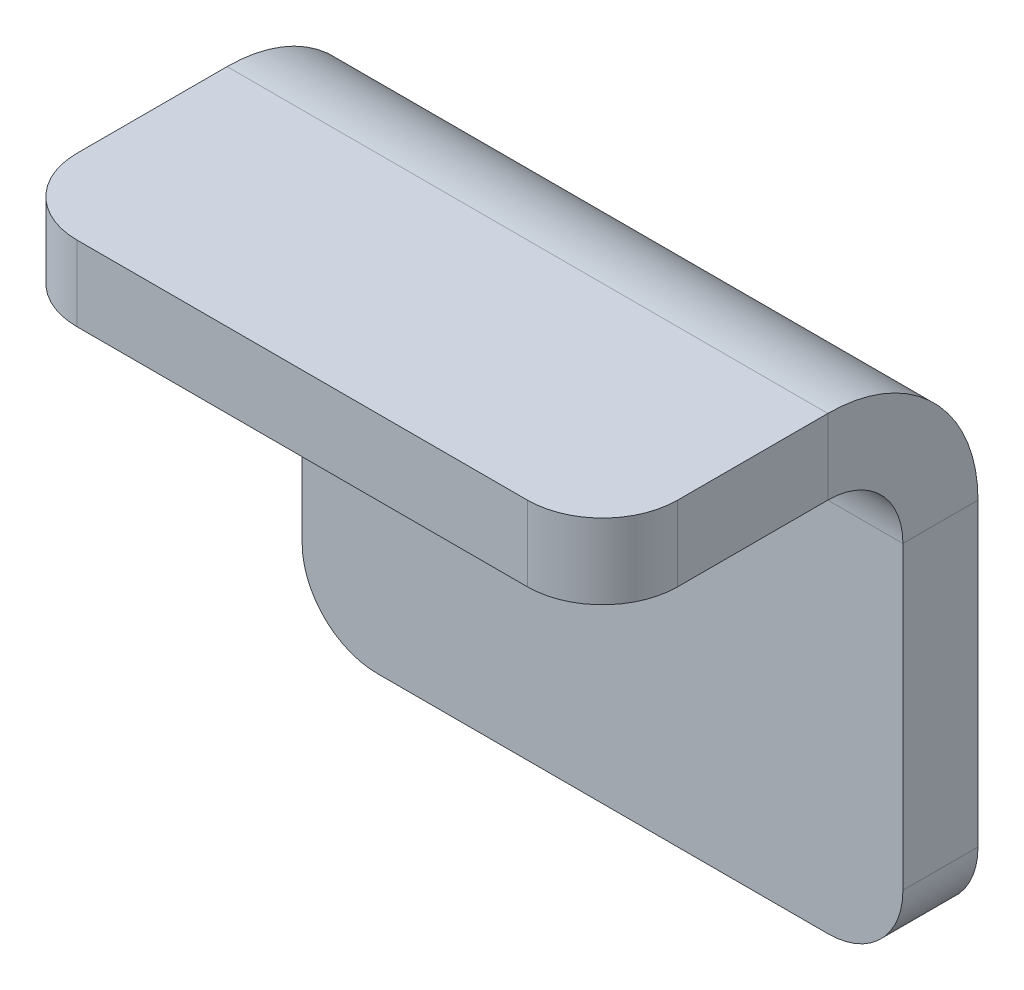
ISO-10303-21;
HEADER;
FILE_DESCRIPTION(('STEP AP214'),'2;1');
FILE_NAME('part.step','',(''),(''),'','','');
FILE_SCHEMA(('AUTOMOTIVE_DESIGN { 1 0 10303 214 1 1 1 1 }'));
ENDSEC;
DATA;
#1=APPLICATION_CONTEXT('core data for automotive mechanical design processes');
#2=APPLICATION_PROTOCOL_DEFINITION('international standard','automotive_design',2000,#1);
#3=PRODUCT_CONTEXT('',#1,'mechanical');
#4=PRODUCT('Part','Part','',(#3));
#5=PRODUCT_RELATED_PRODUCT_CATEGORY('part','',(#4));
#6=PRODUCT_DEFINITION_FORMATION('','',#4);
#7=PRODUCT_DEFINITION_CONTEXT('part definition',#1,'design');
#8=PRODUCT_DEFINITION('design','',#6,#7);
#9=PRODUCT_DEFINITION_SHAPE('','',#8);
#10=(LENGTH_UNIT() NAMED_UNIT(*) SI_UNIT(.MILLI.,.METRE.));
#11=(NAMED_UNIT(*) PLANE_ANGLE_UNIT() SI_UNIT($,.RADIAN.));
#12=(NAMED_UNIT(*) SI_UNIT($,.STERADIAN.) SOLID_ANGLE_UNIT());
#13=UNCERTAINTY_MEASURE_WITH_UNIT(LENGTH_MEASURE(1.E-05),#10,'distance_accuracy_value','');
#14=(GEOMETRIC_REPRESENTATION_CONTEXT(3) GLOBAL_UNCERTAINTY_ASSIGNED_CONTEXT((#13)) GLOBAL_UNIT_ASSIGNED_CONTEXT((#10,
#11,#12)) REPRESENTATION_CONTEXT('',''));
#15=CARTESIAN_POINT('',(0.,0.,0.));
#16=DIRECTION('',(0.,0.,1.));
#17=DIRECTION('',(1.,0.,0.));
#18=AXIS2_PLACEMENT_3D('',#15,#16,#17);
#19=CARTESIAN_POINT('',(-12.7,9.525,-3.175));
#20=DIRECTION('',(-1.,0.,0.));
#21=DIRECTION('',(0.,-1.,0.));
#22=AXIS2_PLACEMENT_3D('',#19,#20,#21);
#23=PLANE('',#22);
#24=DIRECTION('',(0.,-1.,0.));
#25=VECTOR('',#24,1.);
#26=CARTESIAN_POINT('',(-12.7,9.525,-3.175));
#27=LINE('',#26,#25);
#28=CARTESIAN_POINT('',(-12.7,6.35000000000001,-3.175));
#29=VERTEX_POINT('',#28);
#30=CARTESIAN_POINT('',(-12.7,-6.34999999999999,-3.175));
#31=VERTEX_POINT('',#30);
#32=EDGE_CURVE('E187',#29,#31,#27,.T.);
#33=ORIENTED_EDGE('',*,*,#32,.T.);
#34=DIRECTION('',(0.,0.,1.));
#35=VECTOR('',#34,1.);
#36=CARTESIAN_POINT('',(-12.7,-6.35,-3.175));
#37=LINE('',#36,#35);
#38=CARTESIAN_POINT('',(-12.7,-6.34999999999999,0.));
#39=VERTEX_POINT('',#38);
#40=EDGE_CURVE('E194',#31,#39,#37,.T.);
#41=ORIENTED_EDGE('',*,*,#40,.T.);
#42=DIRECTION('',(0.,-1.,0.));
#43=VECTOR('',#42,1.);
#44=CARTESIAN_POINT('',(-12.7,9.525,0.));
#45=LINE('',#44,#43);
#46=CARTESIAN_POINT('',(-12.7,6.35000000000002,0.));
#47=VERTEX_POINT('',#46);
#48=EDGE_CURVE('E196',#47,#39,#45,.T.);
#49=ORIENTED_EDGE('',*,*,#48,.F.);
#50=DIRECTION('',(0.,0.,-1.));
#51=VECTOR('',#50,1.);
#52=CARTESIAN_POINT('',(-12.7,6.35000000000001,0.));
#53=LINE('',#52,#51);
#54=EDGE_CURVE('E171',#47,#29,#53,.T.);
#55=ORIENTED_EDGE('',*,*,#54,.T.);
#56=EDGE_LOOP('',(#33,#41,#49,#55));
#57=FACE_BOUND('',#56,.T.);
#58=ADVANCED_FACE('F36',(#57),#23,.T.);
#59=CARTESIAN_POINT('',(0.,0.,-3.175));
#60=DIRECTION('',(0.,0.,1.));
#61=DIRECTION('',(1.,0.,0.));
#62=AXIS2_PLACEMENT_3D('',#59,#60,#61);
#63=PLANE('',#62);
#64=DIRECTION('',(1.,0.,0.));
#65=VECTOR('',#64,1.);
#66=CARTESIAN_POINT('',(-12.7,-9.525,-3.175));
#67=LINE('',#66,#65);
#68=CARTESIAN_POINT('',(-9.525,-9.525,-3.175));
#69=VERTEX_POINT('',#68);
#70=CARTESIAN_POINT('',(9.52499999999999,-9.525,-3.175));
#71=VERTEX_POINT('',#70);
#72=EDGE_CURVE('E191',#69,#71,#67,.T.);
#73=ORIENTED_EDGE('',*,*,#72,.F.);
#74=CARTESIAN_POINT('',(-9.525,-6.35,-3.175));
#75=DIRECTION('',(0.,0.,1.));
#76=DIRECTION('',(1.,0.,0.));
#77=AXIS2_PLACEMENT_3D('',#74,#75,#76);
#78=CIRCLE('',#77,3.175);
#79=EDGE_CURVE('E214',#69,#31,#78,.F.);
#80=ORIENTED_EDGE('',*,*,#79,.T.);
#81=ORIENTED_EDGE('',*,*,#32,.F.);
#82=DIRECTION('',(-1.,0.,0.));
#83=VECTOR('',#82,1.);
#84=CARTESIAN_POINT('',(-12.7,6.35000000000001,-3.175));
#85=LINE('',#84,#83);
#86=CARTESIAN_POINT('',(12.7,6.35000000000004,-3.175));
#87=VERTEX_POINT('',#86);
#88=EDGE_CURVE('E137',#29,#87,#85,.F.);
#89=ORIENTED_EDGE('',*,*,#88,.T.);
#90=DIRECTION('',(0.,1.,0.));
#91=VECTOR('',#90,1.);
#92=CARTESIAN_POINT('',(12.7,9.525,-3.175));
#93=LINE('',#92,#91);
#94=CARTESIAN_POINT('',(12.7,-6.34999999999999,-3.175));
#95=VERTEX_POINT('',#94);
#96=EDGE_CURVE('E185',#95,#87,#93,.T.);
#97=ORIENTED_EDGE('',*,*,#96,.F.);
#98=CARTESIAN_POINT('',(9.525,-6.35,-3.175));
#99=DIRECTION('',(0.,0.,1.));
#100=DIRECTION('',(1.,0.,0.));
#101=AXIS2_PLACEMENT_3D('',#98,#99,#100);
#102=CIRCLE('',#101,3.175);
#103=EDGE_CURVE('E212',#95,#71,#102,.F.);
#104=ORIENTED_EDGE('',*,*,#103,.T.);
#105=EDGE_LOOP('',(#73,#80,#81,#89,#97,#104));
#106=FACE_BOUND('',#105,.T.);
#107=ADVANCED_FACE('F238',(#106),#63,.F.);
#108=CARTESIAN_POINT('',(0.,0.,0.));
#109=DIRECTION('',(0.,0.,1.));
#110=DIRECTION('',(1.,0.,0.));
#111=AXIS2_PLACEMENT_3D('',#108,#109,#110);
#112=PLANE('',#111);
#113=ORIENTED_EDGE('',*,*,#48,.T.);
#114=CARTESIAN_POINT('',(-9.525,-6.35,0.));
#115=DIRECTION('',(0.,0.,1.));
#116=DIRECTION('',(1.,0.,0.));
#117=AXIS2_PLACEMENT_3D('',#114,#115,#116);
#118=CIRCLE('',#117,3.175);
#119=CARTESIAN_POINT('',(-9.525,-9.525,0.));
#120=VERTEX_POINT('',#119);
#121=EDGE_CURVE('E205',#39,#120,#118,.T.);
#122=ORIENTED_EDGE('',*,*,#121,.T.);
#123=DIRECTION('',(1.,0.,0.));
#124=VECTOR('',#123,1.);
#125=CARTESIAN_POINT('',(-12.7,-9.525,0.));
#126=LINE('',#125,#124);
#127=CARTESIAN_POINT('',(9.52499999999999,-9.525,0.));
#128=VERTEX_POINT('',#127);
#129=EDGE_CURVE('E188',#120,#128,#126,.T.);
#130=ORIENTED_EDGE('',*,*,#129,.T.);
#131=CARTESIAN_POINT('',(9.525,-6.35,0.));
#132=DIRECTION('',(0.,0.,1.));
#133=DIRECTION('',(1.,0.,0.));
#134=AXIS2_PLACEMENT_3D('',#131,#132,#133);
#135=CIRCLE('',#134,3.175);
#136=CARTESIAN_POINT('',(12.7,-6.34999999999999,0.));
#137=VERTEX_POINT('',#136);
#138=EDGE_CURVE('E203',#128,#137,#135,.T.);
#139=ORIENTED_EDGE('',*,*,#138,.T.);
#140=DIRECTION('',(0.,1.,0.));
#141=VECTOR('',#140,1.);
#142=CARTESIAN_POINT('',(12.7,9.525,0.));
#143=LINE('',#142,#141);
#144=CARTESIAN_POINT('',(12.7,6.35000000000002,0.));
#145=VERTEX_POINT('',#144);
#146=EDGE_CURVE('E182',#137,#145,#143,.T.);
#147=ORIENTED_EDGE('',*,*,#146,.T.);
#148=DIRECTION('',(-1.,0.,0.));
#149=VECTOR('',#148,1.);
#150=CARTESIAN_POINT('',(-12.7,6.35000000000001,0.));
#151=LINE('',#150,#149);
#152=EDGE_CURVE('E175',#47,#145,#151,.F.);
#153=ORIENTED_EDGE('',*,*,#152,.F.);
#154=EDGE_LOOP('',(#113,#122,#130,#139,#147,#153));
#155=FACE_BOUND('',#154,.T.);
#156=ADVANCED_FACE('F246',(#155),#112,.T.);
#157=CARTESIAN_POINT('',(12.7,9.525,-3.175));
#158=DIRECTION('',(1.,0.,0.));
#159=DIRECTION('',(0.,1.,0.));
#160=AXIS2_PLACEMENT_3D('',#157,#158,#159);
#161=PLANE('',#160);
#162=ORIENTED_EDGE('',*,*,#146,.F.);
#163=DIRECTION('',(0.,0.,1.));
#164=VECTOR('',#163,1.);
#165=CARTESIAN_POINT('',(12.7,-6.35,-3.175));
#166=LINE('',#165,#164);
#167=EDGE_CURVE('E44',#137,#95,#166,.F.);
#168=ORIENTED_EDGE('',*,*,#167,.T.);
#169=ORIENTED_EDGE('',*,*,#96,.T.);
#170=DIRECTION('',(0.,0.,-1.));
#171=VECTOR('',#170,1.);
#172=CARTESIAN_POINT('',(12.7,6.35000000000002,0.));
#173=LINE('',#172,#171);
#174=EDGE_CURVE('E179',#145,#87,#173,.T.);
#175=ORIENTED_EDGE('',*,*,#174,.F.);
#176=EDGE_LOOP('',(#162,#168,#169,#175));
#177=FACE_BOUND('',#176,.T.);
#178=ADVANCED_FACE('F232',(#177),#161,.T.);
#179=CARTESIAN_POINT('',(-12.7,-9.525,-3.175));
#180=DIRECTION('',(0.,-1.,0.));
#181=DIRECTION('',(0.,0.,-1.));
#182=AXIS2_PLACEMENT_3D('',#179,#180,#181);
#183=PLANE('',#182);
#184=ORIENTED_EDGE('',*,*,#129,.F.);
#185=DIRECTION('',(0.,0.,1.));
#186=VECTOR('',#185,1.);
#187=CARTESIAN_POINT('',(-9.525,-9.525,-3.175));
#188=LINE('',#187,#186);
#189=EDGE_CURVE('E210',#120,#69,#188,.F.);
#190=ORIENTED_EDGE('',*,*,#189,.T.);
#191=ORIENTED_EDGE('',*,*,#72,.T.);
#192=DIRECTION('',(0.,0.,1.));
#193=VECTOR('',#192,1.);
#194=CARTESIAN_POINT('',(9.525,-9.525,-3.175));
#195=LINE('',#194,#193);
#196=EDGE_CURVE('E207',#71,#128,#195,.T.);
#197=ORIENTED_EDGE('',*,*,#196,.T.);
#198=EDGE_LOOP('',(#184,#190,#191,#197));
#199=FACE_BOUND('',#198,.T.);
#200=ADVANCED_FACE('F243',(#199),#183,.T.);
#201=CARTESIAN_POINT('',(12.7,6.35000000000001,3.175));
#202=DIRECTION('',(1.,0.,0.));
#203=DIRECTION('',(0.,1.,0.));
#204=AXIS2_PLACEMENT_3D('',#201,#202,#203);
#205=PLANE('',#204);
#206=DIRECTION('',(0.,1.,0.));
#207=VECTOR('',#206,1.);
#208=CARTESIAN_POINT('',(12.7,9.52500000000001,3.17499999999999));
#209=LINE('',#208,#207);
#210=CARTESIAN_POINT('',(12.7,9.52500000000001,3.17499999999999));
#211=VERTEX_POINT('',#210);
#212=CARTESIAN_POINT('',(12.7,12.7,3.17499999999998));
#213=VERTEX_POINT('',#212);
#214=EDGE_CURVE('E259',#211,#213,#209,.T.);
#215=ORIENTED_EDGE('',*,*,#214,.F.);
#216=CARTESIAN_POINT('',(12.7,6.35000000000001,3.175));
#217=DIRECTION('',(-1.,0.,0.));
#218=DIRECTION('',(0.,-1.,0.));
#219=AXIS2_PLACEMENT_3D('',#216,#217,#218);
#220=CIRCLE('',#219,3.175);
#221=EDGE_CURVE('E140',#145,#211,#220,.F.);
#222=ORIENTED_EDGE('',*,*,#221,.F.);
#223=ORIENTED_EDGE('',*,*,#174,.T.);
#224=CARTESIAN_POINT('',(12.7,6.35000000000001,3.175));
#225=DIRECTION('',(-1.,0.,0.));
#226=DIRECTION('',(0.,-1.,0.));
#227=AXIS2_PLACEMENT_3D('',#224,#225,#226);
#228=CIRCLE('',#227,6.35);
#229=EDGE_CURVE('E170',#87,#213,#228,.F.);
#230=ORIENTED_EDGE('',*,*,#229,.T.);
#231=EDGE_LOOP('',(#215,#222,#223,#230));
#232=FACE_BOUND('',#231,.T.);
#233=ADVANCED_FACE('F268',(#232),#205,.T.);
#234=CARTESIAN_POINT('',(-12.7,6.35000000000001,3.175));
#235=DIRECTION('',(1.,0.,0.));
#236=DIRECTION('',(0.,1.,0.));
#237=AXIS2_PLACEMENT_3D('',#234,#235,#236);
#238=PLANE('',#237);
#239=CARTESIAN_POINT('',(-12.7,6.35000000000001,3.175));
#240=DIRECTION('',(-1.,0.,0.));
#241=DIRECTION('',(0.,-1.,0.));
#242=AXIS2_PLACEMENT_3D('',#239,#240,#241);
#243=CIRCLE('',#242,3.175);
#244=CARTESIAN_POINT('',(-12.7,9.52500000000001,3.17499999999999));
#245=VERTEX_POINT('',#244);
#246=EDGE_CURVE('E147',#245,#47,#243,.T.);
#247=ORIENTED_EDGE('',*,*,#246,.F.);
#248=DIRECTION('',(0.,1.,0.));
#249=VECTOR('',#248,1.);
#250=CARTESIAN_POINT('',(-12.7,9.52500000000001,3.17499999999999));
#251=LINE('',#250,#249);
#252=CARTESIAN_POINT('',(-12.7,12.7,3.17499999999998));
#253=VERTEX_POINT('',#252);
#254=EDGE_CURVE('E144',#245,#253,#251,.T.);
#255=ORIENTED_EDGE('',*,*,#254,.T.);
#256=CARTESIAN_POINT('',(-12.7,6.35000000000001,3.175));
#257=DIRECTION('',(-1.,0.,0.));
#258=DIRECTION('',(0.,-1.,0.));
#259=AXIS2_PLACEMENT_3D('',#256,#257,#258);
#260=CIRCLE('',#259,6.35);
#261=EDGE_CURVE('E129',#253,#29,#260,.T.);
#262=ORIENTED_EDGE('',*,*,#261,.T.);
#263=ORIENTED_EDGE('',*,*,#54,.F.);
#264=EDGE_LOOP('',(#247,#255,#262,#263));
#265=FACE_BOUND('',#264,.T.);
#266=ADVANCED_FACE('F145',(#265),#238,.F.);
#267=CARTESIAN_POINT('',(-12.7,6.35000000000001,3.175));
#268=DIRECTION('',(-1.,0.,0.));
#269=DIRECTION('',(0.,1.,0.));
#270=AXIS2_PLACEMENT_3D('',#267,#268,#269);
#271=CYLINDRICAL_SURFACE('',#270,6.35);
#272=ORIENTED_EDGE('',*,*,#88,.F.);
#273=ORIENTED_EDGE('',*,*,#261,.F.);
#274=DIRECTION('',(1.,0.,0.));
#275=VECTOR('',#274,1.);
#276=CARTESIAN_POINT('',(0.,12.7,3.17499999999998));
#277=LINE('',#276,#275);
#278=EDGE_CURVE('E134',#253,#213,#277,.T.);
#279=ORIENTED_EDGE('',*,*,#278,.T.);
#280=ORIENTED_EDGE('',*,*,#229,.F.);
#281=EDGE_LOOP('',(#272,#273,#279,#280));
#282=FACE_BOUND('',#281,.T.);
#283=ADVANCED_FACE('F131',(#282),#271,.T.);
#284=CARTESIAN_POINT('',(-12.7,6.35000000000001,3.175));
#285=DIRECTION('',(-1.,0.,0.));
#286=DIRECTION('',(0.,1.,0.));
#287=AXIS2_PLACEMENT_3D('',#284,#285,#286);
#288=CYLINDRICAL_SURFACE('',#287,3.175);
#289=ORIENTED_EDGE('',*,*,#152,.T.);
#290=ORIENTED_EDGE('',*,*,#221,.T.);
#291=DIRECTION('',(-1.,0.,0.));
#292=VECTOR('',#291,1.);
#293=CARTESIAN_POINT('',(12.7,9.52500000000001,3.17499999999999));
#294=LINE('',#293,#292);
#295=EDGE_CURVE('E149',#211,#245,#294,.T.);
#296=ORIENTED_EDGE('',*,*,#295,.T.);
#297=ORIENTED_EDGE('',*,*,#246,.T.);
#298=EDGE_LOOP('',(#289,#290,#296,#297));
#299=FACE_BOUND('',#298,.T.);
#300=ADVANCED_FACE('F254',(#299),#288,.F.);
#301=CARTESIAN_POINT('',(12.7,12.7,0.));
#302=DIRECTION('',(-1.,0.,0.));
#303=DIRECTION('',(0.,0.,1.));
#304=AXIS2_PLACEMENT_3D('',#301,#302,#303);
#305=PLANE('',#304);
#306=DIRECTION('',(0.,0.,-1.));
#307=VECTOR('',#306,1.);
#308=CARTESIAN_POINT('',(12.7,12.7,0.));
#309=LINE('',#308,#307);
#310=CARTESIAN_POINT('',(12.7,12.7,9.52499999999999));
#311=VERTEX_POINT('',#310);
#312=EDGE_CURVE('E154',#311,#213,#309,.T.);
#313=ORIENTED_EDGE('',*,*,#312,.F.);
#314=DIRECTION('',(0.,-1.,0.));
#315=VECTOR('',#314,1.);
#316=CARTESIAN_POINT('',(12.7,12.7,9.52499999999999));
#317=LINE('',#316,#315);
#318=CARTESIAN_POINT('',(12.7,9.52500000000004,9.525));
#319=VERTEX_POINT('',#318);
#320=EDGE_CURVE('E11',#311,#319,#317,.T.);
#321=ORIENTED_EDGE('',*,*,#320,.T.);
#322=DIRECTION('',(0.,0.,-1.));
#323=VECTOR('',#322,1.);
#324=CARTESIAN_POINT('',(12.7,9.525,0.));
#325=LINE('',#324,#323);
#326=EDGE_CURVE('E155',#319,#211,#325,.T.);
#327=ORIENTED_EDGE('',*,*,#326,.T.);
#328=ORIENTED_EDGE('',*,*,#214,.T.);
#329=EDGE_LOOP('',(#313,#321,#327,#328));
#330=FACE_BOUND('',#329,.T.);
#331=ADVANCED_FACE('F265',(#330),#305,.F.);
#332=CARTESIAN_POINT('',(-12.7,12.7,12.7));
#333=DIRECTION('',(1.,0.,0.));
#334=DIRECTION('',(0.,0.,-1.));
#335=AXIS2_PLACEMENT_3D('',#332,#333,#334);
#336=PLANE('',#335);
#337=DIRECTION('',(0.,0.,1.));
#338=VECTOR('',#337,1.);
#339=CARTESIAN_POINT('',(-12.7,9.52500000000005,12.7));
#340=LINE('',#339,#338);
#341=CARTESIAN_POINT('',(-12.7,9.52500000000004,9.525));
#342=VERTEX_POINT('',#341);
#343=EDGE_CURVE('E165',#245,#342,#340,.T.);
#344=ORIENTED_EDGE('',*,*,#343,.T.);
#345=DIRECTION('',(0.,-1.,0.));
#346=VECTOR('',#345,1.);
#347=CARTESIAN_POINT('',(-12.7,12.7,9.52499999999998));
#348=LINE('',#347,#346);
#349=CARTESIAN_POINT('',(-12.7,12.7,9.52499999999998));
#350=VERTEX_POINT('',#349);
#351=EDGE_CURVE('E59',#342,#350,#348,.F.);
#352=ORIENTED_EDGE('',*,*,#351,.T.);
#353=DIRECTION('',(0.,0.,1.));
#354=VECTOR('',#353,1.);
#355=CARTESIAN_POINT('',(-12.7,12.7,12.7));
#356=LINE('',#355,#354);
#357=EDGE_CURVE('E152',#253,#350,#356,.T.);
#358=ORIENTED_EDGE('',*,*,#357,.F.);
#359=ORIENTED_EDGE('',*,*,#254,.F.);
#360=EDGE_LOOP('',(#344,#352,#358,#359));
#361=FACE_BOUND('',#360,.T.);
#362=ADVANCED_FACE('F157',(#361),#336,.F.);
#363=CARTESIAN_POINT('',(0.,12.7,0.));
#364=DIRECTION('',(0.,-1.,0.));
#365=DIRECTION('',(0.,0.,-1.));
#366=AXIS2_PLACEMENT_3D('',#363,#364,#365);
#367=PLANE('',#366);
#368=ORIENTED_EDGE('',*,*,#357,.T.);
#369=CARTESIAN_POINT('',(-9.52500000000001,12.7,9.52499999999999));
#370=DIRECTION('',(0.,-1.,0.));
#371=DIRECTION('',(0.,0.,-1.));
#372=AXIS2_PLACEMENT_3D('',#369,#370,#371);
#373=CIRCLE('',#372,3.175);
#374=CARTESIAN_POINT('',(-9.52500000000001,12.7,12.7));
#375=VERTEX_POINT('',#374);
#376=EDGE_CURVE('E227',#350,#375,#373,.F.);
#377=ORIENTED_EDGE('',*,*,#376,.T.);
#378=DIRECTION('',(1.,0.,0.));
#379=VECTOR('',#378,1.);
#380=CARTESIAN_POINT('',(12.7,12.7,12.7));
#381=LINE('',#380,#379);
#382=CARTESIAN_POINT('',(9.52499999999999,12.7,12.7));
#383=VERTEX_POINT('',#382);
#384=EDGE_CURVE('E158',#375,#383,#381,.T.);
#385=ORIENTED_EDGE('',*,*,#384,.T.);
#386=CARTESIAN_POINT('',(9.52499999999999,12.7,9.52499999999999));
#387=DIRECTION('',(0.,-1.,0.));
#388=DIRECTION('',(0.,0.,-1.));
#389=AXIS2_PLACEMENT_3D('',#386,#387,#388);
#390=CIRCLE('',#389,3.175);
#391=EDGE_CURVE('E51',#383,#311,#390,.F.);
#392=ORIENTED_EDGE('',*,*,#391,.T.);
#393=ORIENTED_EDGE('',*,*,#312,.T.);
#394=ORIENTED_EDGE('',*,*,#278,.F.);
#395=EDGE_LOOP('',(#368,#377,#385,#392,#393,#394));
#396=FACE_BOUND('',#395,.T.);
#397=ADVANCED_FACE('F151',(#396),#367,.F.);
#398=CARTESIAN_POINT('',(0.,9.525,0.));
#399=DIRECTION('',(0.,-1.,0.));
#400=DIRECTION('',(0.,0.,-1.));
#401=AXIS2_PLACEMENT_3D('',#398,#399,#400);
#402=PLANE('',#401);
#403=DIRECTION('',(1.,0.,0.));
#404=VECTOR('',#403,1.);
#405=CARTESIAN_POINT('',(12.7,9.52500000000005,12.7));
#406=LINE('',#405,#404);
#407=CARTESIAN_POINT('',(-9.52500000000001,9.52500000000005,12.7));
#408=VERTEX_POINT('',#407);
#409=CARTESIAN_POINT('',(9.52499999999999,9.52500000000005,12.7));
#410=VERTEX_POINT('',#409);
#411=EDGE_CURVE('E161',#408,#410,#406,.T.);
#412=ORIENTED_EDGE('',*,*,#411,.F.);
#413=CARTESIAN_POINT('',(-9.52500000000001,9.52500000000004,9.525));
#414=DIRECTION('',(0.,-1.,0.));
#415=DIRECTION('',(0.,0.,-1.));
#416=AXIS2_PLACEMENT_3D('',#413,#414,#415);
#417=CIRCLE('',#416,3.175);
#418=EDGE_CURVE('E223',#408,#342,#417,.T.);
#419=ORIENTED_EDGE('',*,*,#418,.T.);
#420=ORIENTED_EDGE('',*,*,#343,.F.);
#421=ORIENTED_EDGE('',*,*,#295,.F.);
#422=ORIENTED_EDGE('',*,*,#326,.F.);
#423=CARTESIAN_POINT('',(9.52499999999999,9.52500000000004,9.525));
#424=DIRECTION('',(0.,-1.,0.));
#425=DIRECTION('',(0.,0.,-1.));
#426=AXIS2_PLACEMENT_3D('',#423,#424,#425);
#427=CIRCLE('',#426,3.175);
#428=EDGE_CURVE('E221',#319,#410,#427,.T.);
#429=ORIENTED_EDGE('',*,*,#428,.T.);
#430=EDGE_LOOP('',(#412,#419,#420,#421,#422,#429));
#431=FACE_BOUND('',#430,.T.);
#432=ADVANCED_FACE('F303',(#431),#402,.T.);
#433=CARTESIAN_POINT('',(12.7,12.7,12.7));
#434=DIRECTION('',(0.,0.,-1.));
#435=DIRECTION('',(0.,1.,0.));
#436=AXIS2_PLACEMENT_3D('',#433,#434,#435);
#437=PLANE('',#436);
#438=ORIENTED_EDGE('',*,*,#384,.F.);
#439=DIRECTION('',(0.,-1.,0.));
#440=VECTOR('',#439,1.);
#441=CARTESIAN_POINT('',(-9.52500000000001,12.7,12.7));
#442=LINE('',#441,#440);
#443=EDGE_CURVE('E218',#375,#408,#442,.T.);
#444=ORIENTED_EDGE('',*,*,#443,.T.);
#445=ORIENTED_EDGE('',*,*,#411,.T.);
#446=DIRECTION('',(0.,-1.,0.));
#447=VECTOR('',#446,1.);
#448=CARTESIAN_POINT('',(9.52499999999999,12.7,12.7));
#449=LINE('',#448,#447);
#450=EDGE_CURVE('E216',#410,#383,#449,.F.);
#451=ORIENTED_EDGE('',*,*,#450,.T.);
#452=EDGE_LOOP('',(#438,#444,#445,#451));
#453=FACE_BOUND('',#452,.T.);
#454=ADVANCED_FACE('F291',(#453),#437,.F.);
#455=CARTESIAN_POINT('',(-9.525,-6.35,-3.175));
#456=DIRECTION('',(0.,0.,1.));
#457=DIRECTION('',(1.,0.,0.));
#458=AXIS2_PLACEMENT_3D('',#455,#456,#457);
#459=CYLINDRICAL_SURFACE('',#458,3.175);
#460=ORIENTED_EDGE('',*,*,#79,.F.);
#461=ORIENTED_EDGE('',*,*,#189,.F.);
#462=ORIENTED_EDGE('',*,*,#121,.F.);
#463=ORIENTED_EDGE('',*,*,#40,.F.);
#464=EDGE_LOOP('',(#460,#461,#462,#463));
#465=FACE_BOUND('',#464,.T.);
#466=ADVANCED_FACE('F251',(#465),#459,.T.);
#467=CARTESIAN_POINT('',(-9.52500000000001,12.7,9.52499999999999));
#468=DIRECTION('',(0.,-1.,0.));
#469=DIRECTION('',(0.,0.,-1.));
#470=AXIS2_PLACEMENT_3D('',#467,#468,#469);
#471=CYLINDRICAL_SURFACE('',#470,3.175);
#472=ORIENTED_EDGE('',*,*,#376,.F.);
#473=ORIENTED_EDGE('',*,*,#351,.F.);
#474=ORIENTED_EDGE('',*,*,#418,.F.);
#475=ORIENTED_EDGE('',*,*,#443,.F.);
#476=EDGE_LOOP('',(#472,#473,#474,#475));
#477=FACE_BOUND('',#476,.T.);
#478=ADVANCED_FACE('F290',(#477),#471,.T.);
#479=CARTESIAN_POINT('',(9.525,-6.35,-3.175));
#480=DIRECTION('',(0.,0.,1.));
#481=DIRECTION('',(1.,0.,0.));
#482=AXIS2_PLACEMENT_3D('',#479,#480,#481);
#483=CYLINDRICAL_SURFACE('',#482,3.175);
#484=ORIENTED_EDGE('',*,*,#103,.F.);
#485=ORIENTED_EDGE('',*,*,#167,.F.);
#486=ORIENTED_EDGE('',*,*,#138,.F.);
#487=ORIENTED_EDGE('',*,*,#196,.F.);
#488=EDGE_LOOP('',(#484,#485,#486,#487));
#489=FACE_BOUND('',#488,.T.);
#490=ADVANCED_FACE('F240',(#489),#483,.T.);
#491=CARTESIAN_POINT('',(9.52499999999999,12.7,9.52499999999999));
#492=DIRECTION('',(0.,-1.,0.));
#493=DIRECTION('',(0.,0.,-1.));
#494=AXIS2_PLACEMENT_3D('',#491,#492,#493);
#495=CYLINDRICAL_SURFACE('',#494,3.175);
#496=ORIENTED_EDGE('',*,*,#391,.F.);
#497=ORIENTED_EDGE('',*,*,#450,.F.);
#498=ORIENTED_EDGE('',*,*,#428,.F.);
#499=ORIENTED_EDGE('',*,*,#320,.F.);
#500=EDGE_LOOP('',(#496,#497,#498,#499));
#501=FACE_BOUND('',#500,.T.);
#502=ADVANCED_FACE('F38',(#501),#495,.T.);
#503=CLOSED_SHELL('',(#58,#107,#156,#178,#200,#233,#266,#283,#300,#331,#362,#397,#432,#454,#466,
#478,#490,#502));
#504=MANIFOLD_SOLID_BREP('B2',#503);
#505=ADVANCED_BREP_SHAPE_REPRESENTATION('',(#18,#504),#14);
#506=SHAPE_DEFINITION_REPRESENTATION(#9,#505);
ENDSEC;
END-ISO-10303-21;
